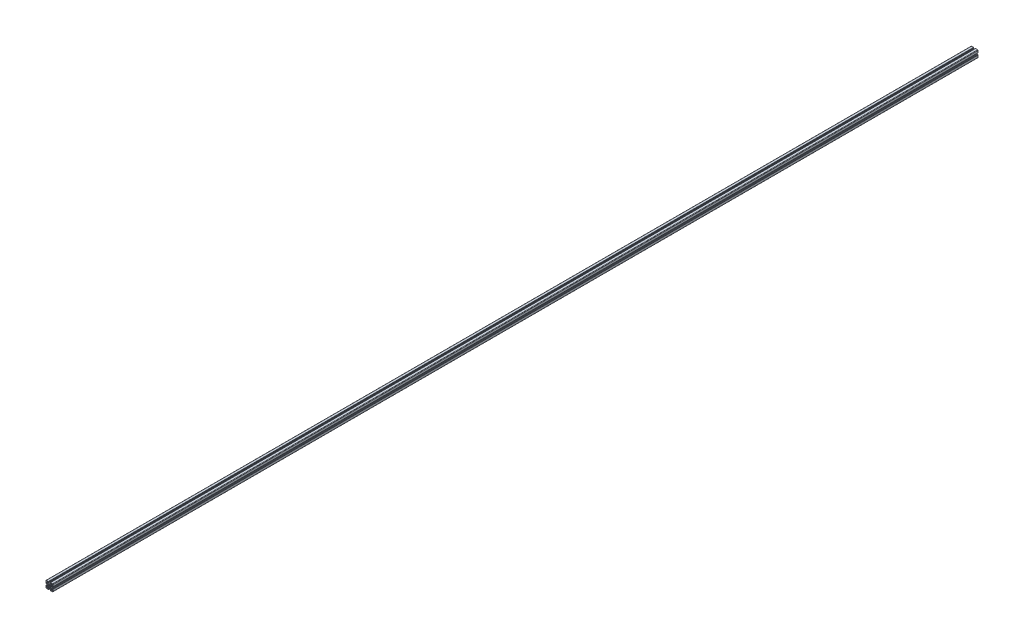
from build123d import *

# Parameters (mm, degrees)
BASE_EXTRUDE_DEPTH = 6000


with BuildPart() as part:
    # Sketch1 → Base-Extrude (new body)
    with BuildSketch(Plane.XY):
        with BuildLine():
            Line((7.973976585, 0.792591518), (7.540060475, 0.046829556))
            ThreePointArc((7.540060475, 0.046829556), (7.534295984, 0.023675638), (7.531329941, 0))
            ThreePointArc((7.531329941, 0), (7.534295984, -0.023675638), (7.540060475, -0.046829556))
            Line((7.540060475, -0.046829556), (7.973976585, -0.792591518))
            ThreePointArc((7.973976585, -0.792591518), (7.996666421, -0.851255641), (8.000014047, -0.914065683))
            ThreePointArc((8.000014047, -0.914065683), (7.719730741, -2.298395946), (7.20036345, -3.611859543))
            ThreePointArc((7.20036345, -3.611859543), (7.018857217, -4.793954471), (7.563483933, -5.85869607))
            Line((7.563483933, -5.85869607), (11.129779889, -9.424988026))
            ThreePointArc((11.129779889, -9.424988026), (11.760624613, -9.84650461), (12.504756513, -9.99452154))
            Line((12.504756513, -9.99452154), (16.316902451, -9.99452154))
            ThreePointArc((16.316902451, -9.99452154), (16.458324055, -9.935942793), (16.516902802, -9.794521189))
            Line((16.516902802, -9.794521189), (16.516902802, -5.200014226))
            ThreePointArc((16.516902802, -5.200014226), (16.575481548, -5.058592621), (16.716903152, -5.000013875))
            Line((16.716903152, -5.000013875), (20.719599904, -5.000013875))
            ThreePointArc((20.719599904, -5.000013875), (20.931731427, -5.087881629), (21.01959918, -5.300013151))
            Line((21.01959918, -5.300013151), (21.01959918, -5.500004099))
            ThreePointArc((21.01959918, -5.500004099), (21.10746708, -5.712135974), (21.319598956, -5.800003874))
            Line((21.319598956, -5.800003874), (21.999979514, -5.800003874))
            ThreePointArc((21.999979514, -5.800003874), (22.35353264, -5.946450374), (22.49997914, -6.300003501))
            Line((22.49997914, -6.300003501), (22.49997914, -19.500016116))
            ThreePointArc((22.49997914, -19.500016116), (21.62130014, -21.621334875), (19.499981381, -22.500013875))
            Line((19.499981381, -22.500013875), (6.375709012, -22.500013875))
            ThreePointArc((6.375709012, -22.500013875), (6.022155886, -22.353567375), (5.875709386, -22.000014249))
            Line((5.875709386, -22.000014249), (5.875709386, -21.30001315))
            ThreePointArc((5.875709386, -21.30001315), (5.787841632, -21.087881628), (5.57571011, -21.000013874))
            Line((5.57571011, -21.000013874), (5.299998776, -21.000013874))
            ThreePointArc((5.299998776, -21.000013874), (5.087867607, -20.912146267), (5, -20.700015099))
            Line((5, -20.700015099), (5, -16.666812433))
            ThreePointArc((5, -16.666812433), (5.058578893, -16.525390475), (5.200000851, -16.466811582))
            Line((5.200000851, -16.466811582), (9.905385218, -16.466811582))
            ThreePointArc((9.905385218, -16.466811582), (10.046806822, -16.408232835), (10.105385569, -16.266811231))
            Line((10.105385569, -16.266811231), (10.105385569, -12.471582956))
            ThreePointArc((10.105385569, -12.471582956), (9.953144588, -11.706215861), (9.519598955, -11.057368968))
            Line((9.519598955, -11.057368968), (5.944897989, -7.482668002))
            ThreePointArc((5.944897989, -7.482668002), (4.854601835, -6.967833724), (3.666499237, -7.173289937))
            ThreePointArc((3.666499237, -7.173289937), (2.309136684, -7.713848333), (0.876396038, -8.000013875))
            ThreePointArc((0.876396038, -8.000013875), (0.81356491, -7.997088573), (0.754749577, -7.974793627))
            Line((0.754749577, -7.974793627), (0.11262846, -7.606936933))
            ThreePointArc((0.11262846, -7.606936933), (0.062963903, -7.559088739), (0, -7.530953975))
            ThreePointArc((0, -7.530953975), (-0.062963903, -7.559088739), (-0.11262846, -7.606936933))
            Line((-0.11262846, -7.606936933), (-0.754749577, -7.974793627))
            ThreePointArc((-0.754749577, -7.974793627), (-0.81356491, -7.997088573), (-0.876396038, -8.000013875))
            ThreePointArc((-0.876396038, -8.000013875), (-2.309136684, -7.713848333), (-3.666499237, -7.173289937))
            ThreePointArc((-3.666499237, -7.173289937), (-4.854601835, -6.967833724), (-5.944897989, -7.482668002))
            Line((-5.944897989, -7.482668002), (-9.519598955, -11.057368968))
            ThreePointArc((-9.519598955, -11.057368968), (-9.953144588, -11.706215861), (-10.105385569, -12.471582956))
            Line((-10.105385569, -12.471582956), (-10.105385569, -16.266811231))
            ThreePointArc((-10.105385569, -16.266811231), (-10.046806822, -16.408232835), (-9.905385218, -16.466811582))
            Line((-9.905385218, -16.466811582), (-5.200000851, -16.466811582))
            ThreePointArc((-5.200000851, -16.466811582), (-5.058578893, -16.525390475), (-5, -16.666812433))
            Line((-5, -16.666812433), (-5, -20.700015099))
            ThreePointArc((-5, -20.700015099), (-5.087867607, -20.912146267), (-5.299998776, -21.000013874))
            Line((-5.299998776, -21.000013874), (-5.57571011, -21.000013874))
            ThreePointArc((-5.57571011, -21.000013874), (-5.787841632, -21.087881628), (-5.875709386, -21.30001315))
            Line((-5.875709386, -21.30001315), (-5.875709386, -22.000014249))
            ThreePointArc((-5.875709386, -22.000014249), (-6.022155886, -22.353567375), (-6.375709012, -22.500013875))
            Line((-6.375709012, -22.500013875), (-19.499981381, -22.500013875))
            ThreePointArc((-19.499981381, -22.500013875), (-21.62130014, -21.621334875), (-22.49997914, -19.500016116))
            Line((-22.49997914, -19.500016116), (-22.49997914, -6.300003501))
            ThreePointArc((-22.49997914, -6.300003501), (-22.35353264, -5.946450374), (-21.999979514, -5.800003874))
            Line((-21.999979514, -5.800003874), (-21.319598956, -5.800003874))
            ThreePointArc((-21.319598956, -5.800003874), (-21.10746708, -5.712135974), (-21.01959918, -5.500004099))
            Line((-21.01959918, -5.500004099), (-21.01959918, -5.300013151))
            ThreePointArc((-21.01959918, -5.300013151), (-20.931731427, -5.087881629), (-20.719599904, -5.000013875))
            Line((-20.719599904, -5.000013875), (-16.716903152, -5.000013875))
            ThreePointArc((-16.716903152, -5.000013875), (-16.575481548, -5.058592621), (-16.516902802, -5.200014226))
            Line((-16.516902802, -5.200014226), (-16.516902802, -9.794521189))
            ThreePointArc((-16.516902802, -9.794521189), (-16.458324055, -9.935942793), (-16.316902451, -9.99452154))
            Line((-16.316902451, -9.99452154), (-12.504756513, -9.99452154))
            ThreePointArc((-12.504756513, -9.99452154), (-11.760624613, -9.84650461), (-11.129779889, -9.424988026))
            Line((-11.129779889, -9.424988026), (-7.563483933, -5.85869607))
            ThreePointArc((-7.563483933, -5.85869607), (-7.018857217, -4.793954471), (-7.20036345, -3.611859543))
            ThreePointArc((-7.20036345, -3.611859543), (-7.719730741, -2.298395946), (-8.000014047, -0.914065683))
            ThreePointArc((-8.000014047, -0.914065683), (-7.996666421, -0.851255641), (-7.973976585, -0.792591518))
            Line((-7.973976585, -0.792591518), (-7.540060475, -0.046829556))
            ThreePointArc((-7.540060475, -0.046829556), (-7.534295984, -0.023675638), (-7.531329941, 0))
            ThreePointArc((-7.531329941, 0), (-7.534295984, 0.023675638), (-7.540060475, 0.046829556))
            Line((-7.540060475, 0.046829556), (-7.973976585, 0.792591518))
            ThreePointArc((-7.973976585, 0.792591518), (-7.996666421, 0.851255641), (-8.000014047, 0.914065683))
            ThreePointArc((-8.000014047, 0.914065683), (-7.719730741, 2.298395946), (-7.20036345, 3.611859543))
            ThreePointArc((-7.20036345, 3.611859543), (-7.018857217, 4.793954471), (-7.563483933, 5.85869607))
            Line((-7.563483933, 5.85869607), (-11.129779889, 9.424988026))
            ThreePointArc((-11.129779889, 9.424988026), (-11.760624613, 9.84650461), (-12.504756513, 9.99452154))
            Line((-12.504756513, 9.99452154), (-16.316902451, 9.99452154))
            ThreePointArc((-16.316902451, 9.99452154), (-16.458324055, 9.935942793), (-16.516902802, 9.794521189))
            Line((-16.516902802, 9.794521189), (-16.516902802, 5.200014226))
            ThreePointArc((-16.516902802, 5.200014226), (-16.575481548, 5.058592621), (-16.716903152, 5.000013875))
            Line((-16.716903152, 5.000013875), (-20.719599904, 5.000013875))
            ThreePointArc((-20.719599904, 5.000013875), (-20.931731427, 5.087881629), (-21.01959918, 5.300013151))
            Line((-21.01959918, 5.300013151), (-21.01959918, 5.500004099))
            ThreePointArc((-21.01959918, 5.500004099), (-21.10746708, 5.712135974), (-21.319598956, 5.800003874))
            Line((-21.319598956, 5.800003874), (-21.999979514, 5.800003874))
            ThreePointArc((-21.999979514, 5.800003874), (-22.35353264, 5.946450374), (-22.49997914, 6.300003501))
            Line((-22.49997914, 6.300003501), (-22.49997914, 19.500016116))
            ThreePointArc((-22.49997914, 19.500016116), (-21.62130014, 21.621334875), (-19.499981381, 22.500013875))
            Line((-19.499981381, 22.500013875), (-6.375709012, 22.500013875))
            ThreePointArc((-6.375709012, 22.500013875), (-6.022155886, 22.353567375), (-5.875709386, 22.000014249))
            Line((-5.875709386, 22.000014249), (-5.875709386, 21.30001315))
            ThreePointArc((-5.875709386, 21.30001315), (-5.787841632, 21.087881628), (-5.57571011, 21.000013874))
            Line((-5.57571011, 21.000013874), (-5.299998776, 21.000013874))
            ThreePointArc((-5.299998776, 21.000013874), (-5.087867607, 20.912146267), (-5, 20.700015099))
            Line((-5, 20.700015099), (-5, 16.666812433))
            ThreePointArc((-5, 16.666812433), (-5.058578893, 16.525390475), (-5.200000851, 16.466811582))
            Line((-5.200000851, 16.466811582), (-9.905385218, 16.466811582))
            ThreePointArc((-9.905385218, 16.466811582), (-10.046806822, 16.408232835), (-10.105385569, 16.266811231))
            Line((-10.105385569, 16.266811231), (-10.105385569, 12.471582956))
            ThreePointArc((-10.105385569, 12.471582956), (-9.953144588, 11.706215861), (-9.519598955, 11.057368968))
            Line((-9.519598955, 11.057368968), (-5.944897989, 7.482668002))
            ThreePointArc((-5.944897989, 7.482668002), (-4.854601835, 6.967833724), (-3.666499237, 7.173289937))
            ThreePointArc((-3.666499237, 7.173289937), (-2.309136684, 7.713848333), (-0.876396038, 8.000013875))
            ThreePointArc((-0.876396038, 8.000013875), (-0.81356491, 7.997088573), (-0.754749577, 7.974793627))
            Line((-0.754749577, 7.974793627), (-0.11262846, 7.606936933))
            ThreePointArc((-0.11262846, 7.606936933), (-0.062963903, 7.559088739), (0, 7.530953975))
            ThreePointArc((0, 7.530953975), (0.062963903, 7.559088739), (0.11262846, 7.606936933))
            Line((0.11262846, 7.606936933), (0.754749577, 7.974793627))
            ThreePointArc((0.754749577, 7.974793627), (0.81356491, 7.997088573), (0.876396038, 8.000013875))
            ThreePointArc((0.876396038, 8.000013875), (2.309136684, 7.713848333), (3.666499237, 7.173289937))
            ThreePointArc((3.666499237, 7.173289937), (4.854601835, 6.967833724), (5.944897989, 7.482668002))
            Line((5.944897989, 7.482668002), (9.519598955, 11.057368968))
            ThreePointArc((9.519598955, 11.057368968), (9.953144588, 11.706215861), (10.105385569, 12.471582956))
            Line((10.105385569, 12.471582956), (10.105385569, 16.266811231))
            ThreePointArc((10.105385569, 16.266811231), (10.046806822, 16.408232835), (9.905385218, 16.466811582))
            Line((9.905385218, 16.466811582), (5.200000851, 16.466811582))
            ThreePointArc((5.200000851, 16.466811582), (5.058578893, 16.525390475), (5, 16.666812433))
            Line((5, 16.666812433), (5, 20.700015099))
            ThreePointArc((5, 20.700015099), (5.087867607, 20.912146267), (5.299998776, 21.000013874))
            Line((5.299998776, 21.000013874), (5.57571011, 21.000013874))
            ThreePointArc((5.57571011, 21.000013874), (5.787841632, 21.087881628), (5.875709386, 21.30001315))
            Line((5.875709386, 21.30001315), (5.875709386, 22.000014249))
            ThreePointArc((5.875709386, 22.000014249), (6.022155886, 22.353567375), (6.375709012, 22.500013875))
            Line((6.375709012, 22.500013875), (19.499981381, 22.500013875))
            ThreePointArc((19.499981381, 22.500013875), (21.62130014, 21.621334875), (22.49997914, 19.500016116))
            Line((22.49997914, 19.500016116), (22.49997914, 6.300003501))
            ThreePointArc((22.49997914, 6.300003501), (22.35353264, 5.946450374), (21.999979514, 5.800003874))
            Line((21.999979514, 5.800003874), (21.319598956, 5.800003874))
            ThreePointArc((21.319598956, 5.800003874), (21.10746708, 5.712135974), (21.01959918, 5.500004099))
            Line((21.01959918, 5.500004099), (21.01959918, 5.300013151))
            ThreePointArc((21.01959918, 5.300013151), (20.931731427, 5.087881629), (20.719599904, 5.000013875))
            Line((20.719599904, 5.000013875), (16.716903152, 5.000013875))
            ThreePointArc((16.716903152, 5.000013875), (16.575481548, 5.058592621), (16.516902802, 5.200014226))
            Line((16.516902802, 5.200014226), (16.516902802, 9.794521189))
            ThreePointArc((16.516902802, 9.794521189), (16.458324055, 9.935942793), (16.316902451, 9.99452154))
            Line((16.316902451, 9.99452154), (12.504756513, 9.99452154))
            ThreePointArc((12.504756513, 9.99452154), (11.760624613, 9.84650461), (11.129779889, 9.424988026))
            Line((11.129779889, 9.424988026), (7.563483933, 5.85869607))
            ThreePointArc((7.563483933, 5.85869607), (7.018857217, 4.793954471), (7.20036345, 3.611859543))
            ThreePointArc((7.20036345, 3.611859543), (7.719730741, 2.298395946), (8.000014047, 0.914065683))
            ThreePointArc((8.000014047, 0.914065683), (7.996666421, 0.851255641), (7.973976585, 0.792591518))
        make_face()
        with BuildLine():
            Line((10.549978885, 18.000013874), (8.999979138, 18.000013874))
            ThreePointArc((8.999979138, 18.000013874), (7.499979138, 19.500013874), (8.999979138, 21.000013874))
            Line((8.999979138, 21.000013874), (18.499981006, 21.000013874))
            ThreePointArc((18.499981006, 21.000013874), (20.267746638, 20.267781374), (20.999979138, 18.500015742))
            Line((20.999979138, 18.500015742), (20.999979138, 9.000204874))
            ThreePointArc((20.999979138, 9.000204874), (19.499979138, 7.500204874), (17.999979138, 9.000204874))
            Line((17.999979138, 9.000204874), (17.999979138, 10.550013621))
            ThreePointArc((17.999979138, 10.550013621), (17.707086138, 11.257119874), (16.999979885, 11.550012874))
            Line((16.999979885, 11.550012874), (12.549977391, 11.550012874))
            ThreePointArc((12.549977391, 11.550012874), (11.842871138, 11.842905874), (11.549978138, 12.550012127))
            Line((11.549978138, 12.550012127), (11.549978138, 17.000014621))
            ThreePointArc((11.549978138, 17.000014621), (11.257085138, 17.707120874), (10.549978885, 18.000013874))
        make_face(mode=Mode.SUBTRACT)
        with BuildLine():
            Line((-0.867388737, 4.924188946), (-0.96752168, 5.481112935))
            ThreePointArc((-0.96752168, 5.481112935), (-1.187855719, 5.829589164), (-1.595071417, 5.894072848))
            ThreePointArc((-1.595071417, 5.894072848), (-2.338895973, 5.643477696), (-3.04438497, 5.299445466))
            ThreePointArc((-3.04438497, 5.299445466), (-3.284615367, 4.964275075), (-3.191311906, 4.562598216))
            Line((-3.191311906, 4.562598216), (-2.864000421, 4.09847552))
            ThreePointArc((-2.864000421, 4.09847552), (-3.53013295, 3.540926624), (-4.08971289, 2.876499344))
            Line((-4.08971289, 2.876499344), (-4.566777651, 3.208162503))
            ThreePointArc((-4.566777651, 3.208162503), (-4.968960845, 3.298770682), (-5.302497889, 3.056460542))
            ThreePointArc((-5.302497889, 3.056460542), (-5.651259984, 2.353310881), (-5.906847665, 1.611199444))
            ThreePointArc((-5.906847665, 1.611199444), (-5.839752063, 1.204293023), (-5.489730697, 0.98621116))
            Line((-5.489730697, 0.98621116), (-4.920545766, 0.887822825))
            ThreePointArc((-4.920545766, 0.887822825), (-4.980096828, 0.445685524), (-5, 0))
            ThreePointArc((-5, 0), (-4.980096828, -0.445685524), (-4.920545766, -0.887822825))
            Line((-4.920545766, -0.887822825), (-5.489730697, -0.98621116))
            ThreePointArc((-5.489730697, -0.98621116), (-5.839752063, -1.204293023), (-5.906847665, -1.611199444))
            ThreePointArc((-5.906847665, -1.611199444), (-5.651259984, -2.353310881), (-5.302497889, -3.056460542))
            ThreePointArc((-5.302497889, -3.056460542), (-4.968960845, -3.298770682), (-4.566777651, -3.208162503))
            Line((-4.566777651, -3.208162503), (-4.08971289, -2.876499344))
            ThreePointArc((-4.08971289, -2.876499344), (-3.53013295, -3.540926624), (-2.864000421, -4.09847552))
            Line((-2.864000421, -4.09847552), (-3.191311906, -4.562598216))
            ThreePointArc((-3.191311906, -4.562598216), (-3.284615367, -4.964275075), (-3.04438497, -5.299445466))
            ThreePointArc((-3.04438497, -5.299445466), (-2.338895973, -5.643477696), (-1.595071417, -5.894072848))
            ThreePointArc((-1.595071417, -5.894072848), (-1.187855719, -5.829589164), (-0.96752168, -5.481112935))
            Line((-0.96752168, -5.481112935), (-0.867388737, -4.924188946))
            ThreePointArc((-0.867388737, -4.924188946), (0, -5), (0.867388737, -4.924188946))
            Line((0.867388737, -4.924188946), (0.96752168, -5.481112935))
            ThreePointArc((0.96752168, -5.481112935), (1.187855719, -5.829589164), (1.595071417, -5.894072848))
            ThreePointArc((1.595071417, -5.894072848), (2.338895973, -5.643477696), (3.04438497, -5.299445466))
            ThreePointArc((3.04438497, -5.299445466), (3.284615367, -4.964275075), (3.191311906, -4.562598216))
            Line((3.191311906, -4.562598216), (2.864000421, -4.09847552))
            ThreePointArc((2.864000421, -4.09847552), (3.53013295, -3.540926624), (4.08971289, -2.876499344))
            Line((4.08971289, -2.876499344), (4.566777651, -3.208162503))
            ThreePointArc((4.566777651, -3.208162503), (4.968960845, -3.298770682), (5.302497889, -3.056460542))
            ThreePointArc((5.302497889, -3.056460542), (5.651259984, -2.353310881), (5.906847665, -1.611199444))
            ThreePointArc((5.906847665, -1.611199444), (5.839752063, -1.204293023), (5.489730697, -0.98621116))
            Line((5.489730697, -0.98621116), (4.920545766, -0.887822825))
            ThreePointArc((4.920545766, -0.887822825), (4.980096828, -0.445685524), (5, 0))
            ThreePointArc((5, 0), (4.980096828, 0.445685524), (4.920545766, 0.887822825))
            Line((4.920545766, 0.887822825), (5.489730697, 0.98621116))
            ThreePointArc((5.489730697, 0.98621116), (5.839752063, 1.204293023), (5.906847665, 1.611199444))
            ThreePointArc((5.906847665, 1.611199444), (5.651259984, 2.353310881), (5.302497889, 3.056460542))
            ThreePointArc((5.302497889, 3.056460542), (4.968960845, 3.298770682), (4.566777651, 3.208162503))
            Line((4.566777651, 3.208162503), (4.08971289, 2.876499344))
            ThreePointArc((4.08971289, 2.876499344), (3.53013295, 3.540926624), (2.864000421, 4.09847552))
            Line((2.864000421, 4.09847552), (3.191311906, 4.562598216))
            ThreePointArc((3.191311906, 4.562598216), (3.284615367, 4.964275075), (3.04438497, 5.299445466))
            ThreePointArc((3.04438497, 5.299445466), (2.338895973, 5.643477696), (1.595071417, 5.894072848))
            ThreePointArc((1.595071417, 5.894072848), (1.187855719, 5.829589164), (0.96752168, 5.481112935))
            Line((0.96752168, 5.481112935), (0.867388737, 4.924188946))
            ThreePointArc((0.867388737, 4.924188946), (0, 5), (-0.867388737, 4.924188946))
        make_face(mode=Mode.SUBTRACT)
        with BuildLine():
            Line((-10.549978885, -18.000013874), (-8.999979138, -18.000013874))
            ThreePointArc((-8.999979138, -18.000013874), (-7.499979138, -19.500013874), (-8.999979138, -21.000013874))
            Line((-8.999979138, -21.000013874), (-18.499981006, -21.000013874))
            ThreePointArc((-18.499981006, -21.000013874), (-20.267746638, -20.267781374), (-20.999979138, -18.500015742))
            Line((-20.999979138, -18.500015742), (-20.999979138, -9.000204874))
            ThreePointArc((-20.999979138, -9.000204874), (-19.499979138, -7.500204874), (-17.999979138, -9.000204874))
            Line((-17.999979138, -9.000204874), (-17.999979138, -10.550013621))
            ThreePointArc((-17.999979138, -10.550013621), (-17.707086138, -11.257119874), (-16.999979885, -11.550012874))
            Line((-16.999979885, -11.550012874), (-12.549977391, -11.550012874))
            ThreePointArc((-12.549977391, -11.550012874), (-11.842871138, -11.842905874), (-11.549978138, -12.550012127))
            Line((-11.549978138, -12.550012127), (-11.549978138, -17.000014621))
            ThreePointArc((-11.549978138, -17.000014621), (-11.257085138, -17.707120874), (-10.549978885, -18.000013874))
        make_face(mode=Mode.SUBTRACT)
        with BuildLine():
            Line((-11.549978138, 12.550012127), (-11.549978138, 17.000014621))
            ThreePointArc((-11.549978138, 17.000014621), (-11.257085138, 17.707120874), (-10.549978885, 18.000013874))
            Line((-10.549978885, 18.000013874), (-8.999979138, 18.000013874))
            ThreePointArc((-8.999979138, 18.000013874), (-7.499979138, 19.500013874), (-8.999979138, 21.000013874))
            Line((-8.999979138, 21.000013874), (-18.499981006, 21.000013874))
            ThreePointArc((-18.499981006, 21.000013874), (-20.267746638, 20.267781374), (-20.999979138, 18.500015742))
            Line((-20.999979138, 18.500015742), (-20.999979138, 9.000204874))
            ThreePointArc((-20.999979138, 9.000204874), (-19.499979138, 7.500204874), (-17.999979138, 9.000204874))
            Line((-17.999979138, 9.000204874), (-17.999979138, 10.550013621))
            ThreePointArc((-17.999979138, 10.550013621), (-17.707086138, 11.257119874), (-16.999979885, 11.550012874))
            Line((-16.999979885, 11.550012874), (-12.549977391, 11.550012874))
            ThreePointArc((-12.549977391, 11.550012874), (-11.842871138, 11.842905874), (-11.549978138, 12.550012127))
        make_face(mode=Mode.SUBTRACT)
        with BuildLine():
            Line((11.549978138, -12.550012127), (11.549978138, -17.000014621))
            ThreePointArc((11.549978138, -17.000014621), (11.257085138, -17.707120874), (10.549978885, -18.000013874))
            Line((10.549978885, -18.000013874), (8.999979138, -18.000013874))
            ThreePointArc((8.999979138, -18.000013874), (7.499979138, -19.500013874), (8.999979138, -21.000013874))
            Line((8.999979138, -21.000013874), (18.499981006, -21.000013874))
            ThreePointArc((18.499981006, -21.000013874), (20.267746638, -20.267781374), (20.999979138, -18.500015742))
            Line((20.999979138, -18.500015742), (20.999979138, -9.000204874))
            ThreePointArc((20.999979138, -9.000204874), (19.499979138, -7.500204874), (17.999979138, -9.000204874))
            Line((17.999979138, -9.000204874), (17.999979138, -10.550013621))
            ThreePointArc((17.999979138, -10.550013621), (17.707086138, -11.257119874), (16.999979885, -11.550012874))
            Line((16.999979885, -11.550012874), (12.549977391, -11.550012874))
            ThreePointArc((12.549977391, -11.550012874), (11.842871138, -11.842905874), (11.549978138, -12.550012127))
        make_face(mode=Mode.SUBTRACT)
    extrude(amount=-BASE_EXTRUDE_DEPTH)


solid = part.part
